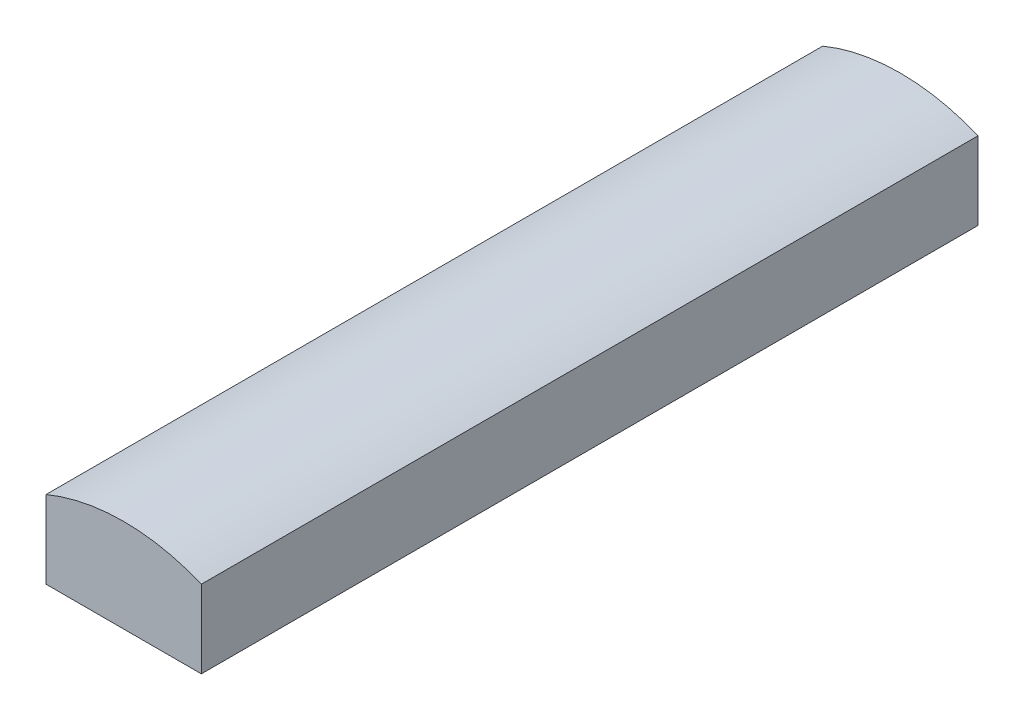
from build123d import *

# Parameters (mm, degrees)
LINEAR_AUSTRAGEN1_DEPTH         = 500
SKIZZE4_R                       = 0.05
LINEAR_AUSTRAGEN3_DEPTH         = 0.1
SCHNITT_LINEAR_START            = -0.1
SCHNITT_LINEAR_AUSTRAGEN1_DEPTH = 0.1


with BuildPart() as part:
    # Skizze1 → Linear austragen1 (new body)
    with BuildSketch(Plane.XY):
        with BuildLine():
            Line((550, 50), (550, 0))
            Line((550, 0), (450, 0))
            Line((450, 0), (450, 50))
            ThreePointArc((450, 50), (500, 60), (550, 50))
        make_face()
    extrude(amount=-LINEAR_AUSTRAGEN1_DEPTH)

    # Skizze4 → Linear austragen3 (add)
    with BuildSketch(Plane.XZ):
        with Locations(Location((500.950908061, -479.345692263, 0), (0, 0, 270))):
            Circle(SKIZZE4_R)
    extrude(amount=LINEAR_AUSTRAGEN3_DEPTH)

    # Skizze2 → Schnitt-Linear austragen1 (cut)
    with BuildSketch(Plane.XY.offset(SCHNITT_LINEAR_START)):
        with BuildLine():
            Line((450, 50), (450, 0))
            Line((450, 0), (550, 0))
            Line((550, 0), (550, 50))
            ThreePointArc((550, 50), (500, 60), (450, 50))
        make_face()
    extrude(amount=SCHNITT_LINEAR_AUSTRAGEN1_DEPTH, mode=Mode.SUBTRACT)


solid = part.part
